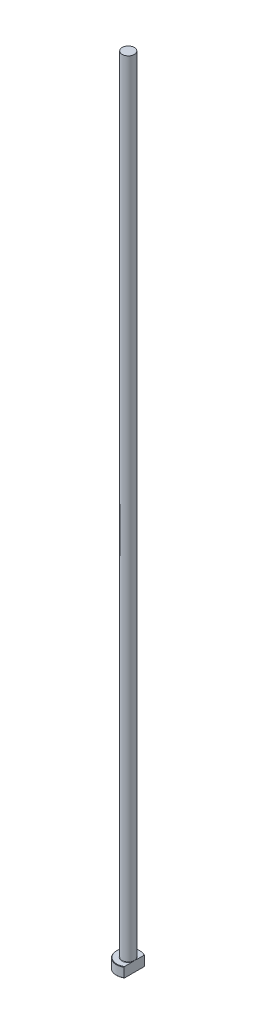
from build123d import *
from build123d.topology import SkipClean

# Parameters (mm, degrees)
CHAMFER1_SIZE = 0.2
FILLET1_R     = 0.2
KEY_DEPTH     = 401.089989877


with BuildPart() as part:
    # Sketch1 → Revolve1 (revolve)
    with BuildSketch(Plane.XY, mode=Mode.PRIVATE) as revolve1_sk:
        Polygon((0, 0), (-6, 0), (-6, 5), (-3.05, 5), (-3.05, 400), (0, 400), align=None)
    revolve(revolve1_sk.sketch.rotate(Axis((0, 259.958771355, 0), (0, -1, 0)), 270), axis=Axis((0, 259.958771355, 0), (0, -1, 0)))

    # Chamfer1
    chamfer1_edges = [part.edges().sort_by_distance(p)[0] for p in [
        (0, 5, -6),
        (0, 0, -6),
    ]]
    chamfer(chamfer1_edges, length=CHAMFER1_SIZE)

    # Fillet1
    fillet1_edges = [part.edges().sort_by_distance(p)[0] for p in [
        (0, 5, -3.05),
    ]]
    fillet(fillet1_edges, radius=FILLET1_R)

    # Sketch2 → KEY (cut, through all)
    with SkipClean():  # the faces are left unmerged after this step: merging them gives an invalid solid
        with BuildSketch(Plane(origin=(0, 0, 0), x_dir=(1, 0, 0), z_dir=(0, 1, 0))):
            with BuildLine():
                Line((3.05, 5.166962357), (3.05, -5.166962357))
                ThreePointArc((3.05, -5.166962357), (6, 0), (3.05, 5.166962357))
            make_face()
        extrude(amount=KEY_DEPTH, mode=Mode.SUBTRACT)


solid = part.part
